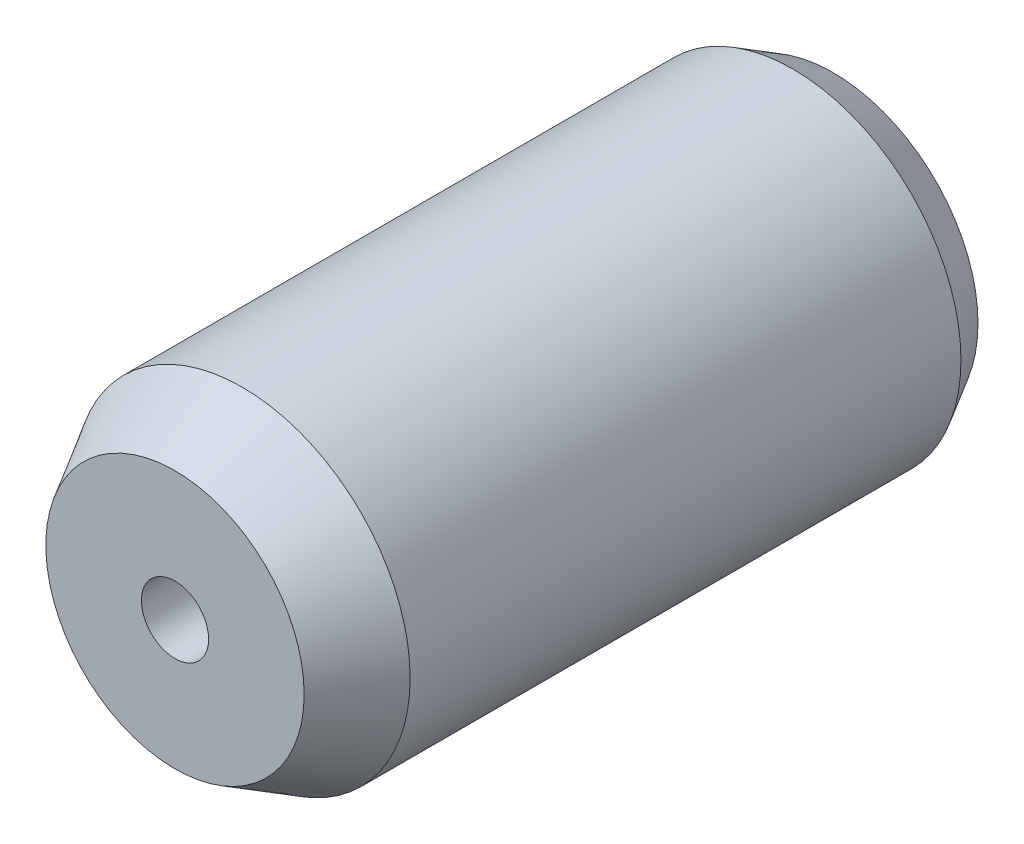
ISO-10303-21;
HEADER;
FILE_DESCRIPTION(('STEP AP214'),'2;1');
FILE_NAME('part.step','',(''),(''),'','','');
FILE_SCHEMA(('AUTOMOTIVE_DESIGN { 1 0 10303 214 1 1 1 1 }'));
ENDSEC;
DATA;
#1=APPLICATION_CONTEXT('core data for automotive mechanical design processes');
#2=APPLICATION_PROTOCOL_DEFINITION('international standard','automotive_design',2000,#1);
#3=PRODUCT_CONTEXT('',#1,'mechanical');
#4=PRODUCT('Part','Part','',(#3));
#5=PRODUCT_RELATED_PRODUCT_CATEGORY('part','',(#4));
#6=PRODUCT_DEFINITION_FORMATION('','',#4);
#7=PRODUCT_DEFINITION_CONTEXT('part definition',#1,'design');
#8=PRODUCT_DEFINITION('design','',#6,#7);
#9=PRODUCT_DEFINITION_SHAPE('','',#8);
#10=(LENGTH_UNIT() NAMED_UNIT(*) SI_UNIT(.MILLI.,.METRE.));
#11=(NAMED_UNIT(*) PLANE_ANGLE_UNIT() SI_UNIT($,.RADIAN.));
#12=(NAMED_UNIT(*) SI_UNIT($,.STERADIAN.) SOLID_ANGLE_UNIT());
#13=UNCERTAINTY_MEASURE_WITH_UNIT(LENGTH_MEASURE(1.E-05),#10,'distance_accuracy_value','');
#14=(GEOMETRIC_REPRESENTATION_CONTEXT(3) GLOBAL_UNCERTAINTY_ASSIGNED_CONTEXT((#13)) GLOBAL_UNIT_ASSIGNED_CONTEXT((#10,
#11,#12)) REPRESENTATION_CONTEXT('',''));
#15=CARTESIAN_POINT('',(0.,0.,0.));
#16=DIRECTION('',(0.,0.,1.));
#17=DIRECTION('',(1.,0.,0.));
#18=AXIS2_PLACEMENT_3D('',#15,#16,#17);
#19=CARTESIAN_POINT('',(0.,0.,0.));
#20=DIRECTION('',(0.,0.,1.));
#21=DIRECTION('',(1.,0.,0.));
#22=AXIS2_PLACEMENT_3D('',#19,#20,#21);
#23=PLANE('',#22);
#24=CARTESIAN_POINT('',(0.,0.,0.));
#25=DIRECTION('',(0.,0.,1.));
#26=DIRECTION('',(1.,0.,0.));
#27=AXIS2_PLACEMENT_3D('',#24,#25,#26);
#28=CIRCLE('',#27,10.7679491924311);
#29=CARTESIAN_POINT('',(10.7679491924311,0.,0.));
#30=VERTEX_POINT('',#29);
#31=EDGE_CURVE('E8',#30,#30,#28,.T.);
#32=ORIENTED_EDGE('',*,*,#31,.F.);
#33=EDGE_LOOP('',(#32));
#34=FACE_BOUND('',#33,.T.);
#35=ADVANCED_FACE('F13',(#34),#23,.F.);
#36=CARTESIAN_POINT('',(0.,0.,3.));
#37=DIRECTION('',(0.,0.,1.));
#38=DIRECTION('',(1.,0.,0.));
#39=AXIS2_PLACEMENT_3D('',#36,#37,#38);
#40=CONICAL_SURFACE('',#39,12.5,0.523598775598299);
#41=ORIENTED_EDGE('',*,*,#31,.T.);
#42=EDGE_LOOP('',(#41));
#43=FACE_BOUND('',#42,.T.);
#44=CARTESIAN_POINT('',(0.,0.,3.));
#45=DIRECTION('',(0.,0.,1.));
#46=DIRECTION('',(1.,0.,0.));
#47=AXIS2_PLACEMENT_3D('',#44,#45,#46);
#48=CIRCLE('',#47,12.5);
#49=CARTESIAN_POINT('',(12.5,0.,3.));
#50=VERTEX_POINT('',#49);
#51=EDGE_CURVE('E19',#50,#50,#48,.T.);
#52=ORIENTED_EDGE('',*,*,#51,.F.);
#53=EDGE_LOOP('',(#52));
#54=FACE_BOUND('',#53,.T.);
#55=ADVANCED_FACE('F61',(#43,#54),#40,.T.);
#56=CARTESIAN_POINT('',(0.,0.,50.));
#57=DIRECTION('',(0.,0.,1.));
#58=DIRECTION('',(1.,0.,0.));
#59=AXIS2_PLACEMENT_3D('',#56,#57,#58);
#60=CYLINDRICAL_SURFACE('',#59,12.5);
#61=CARTESIAN_POINT('',(0.,0.,44.));
#62=DIRECTION('',(0.,0.,1.));
#63=DIRECTION('',(1.,0.,0.));
#64=AXIS2_PLACEMENT_3D('',#61,#62,#63);
#65=CIRCLE('',#64,12.5);
#66=CARTESIAN_POINT('',(12.5,0.,44.));
#67=VERTEX_POINT('',#66);
#68=EDGE_CURVE('E23',#67,#67,#65,.T.);
#69=ORIENTED_EDGE('',*,*,#68,.F.);
#70=EDGE_LOOP('',(#69));
#71=FACE_BOUND('',#70,.T.);
#72=ORIENTED_EDGE('',*,*,#51,.T.);
#73=EDGE_LOOP('',(#72));
#74=FACE_BOUND('',#73,.T.);
#75=ADVANCED_FACE('F56',(#71,#74),#60,.T.);
#76=CARTESIAN_POINT('',(0.,0.,44.));
#77=DIRECTION('',(0.,0.,-1.));
#78=DIRECTION('',(-1.,0.,0.));
#79=AXIS2_PLACEMENT_3D('',#76,#77,#78);
#80=CONICAL_SURFACE('',#79,12.5,0.523598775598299);
#81=CARTESIAN_POINT('',(0.,0.,49.));
#82=DIRECTION('',(0.,0.,1.));
#83=DIRECTION('',(1.,0.,0.));
#84=AXIS2_PLACEMENT_3D('',#81,#82,#83);
#85=CIRCLE('',#84,9.61324865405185);
#86=CARTESIAN_POINT('',(9.61324865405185,0.,49.));
#87=VERTEX_POINT('',#86);
#88=EDGE_CURVE('E27',#87,#87,#85,.T.);
#89=ORIENTED_EDGE('',*,*,#88,.F.);
#90=EDGE_LOOP('',(#89));
#91=FACE_BOUND('',#90,.T.);
#92=ORIENTED_EDGE('',*,*,#68,.T.);
#93=EDGE_LOOP('',(#92));
#94=FACE_BOUND('',#93,.T.);
#95=ADVANCED_FACE('F50',(#91,#94),#80,.T.);
#96=CARTESIAN_POINT('',(9.61324865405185,0.,49.));
#97=DIRECTION('',(0.,0.,-1.));
#98=DIRECTION('',(-1.,0.,0.));
#99=AXIS2_PLACEMENT_3D('',#96,#97,#98);
#100=PLANE('',#99);
#101=CARTESIAN_POINT('',(0.,0.,49.));
#102=DIRECTION('',(0.,0.,1.));
#103=DIRECTION('',(1.,0.,0.));
#104=AXIS2_PLACEMENT_3D('',#101,#102,#103);
#105=CIRCLE('',#104,2.5);
#106=CARTESIAN_POINT('',(2.5,0.,49.));
#107=VERTEX_POINT('',#106);
#108=EDGE_CURVE('E32',#107,#107,#105,.T.);
#109=ORIENTED_EDGE('',*,*,#108,.F.);
#110=EDGE_LOOP('',(#109));
#111=FACE_BOUND('',#110,.T.);
#112=ORIENTED_EDGE('',*,*,#88,.T.);
#113=EDGE_LOOP('',(#112));
#114=FACE_BOUND('',#113,.T.);
#115=ADVANCED_FACE('F44',(#111,#114),#100,.F.);
#116=CARTESIAN_POINT('',(0.,0.,50.));
#117=DIRECTION('',(0.,0.,1.));
#118=DIRECTION('',(1.,0.,0.));
#119=AXIS2_PLACEMENT_3D('',#116,#117,#118);
#120=CYLINDRICAL_SURFACE('',#119,2.5);
#121=CARTESIAN_POINT('',(0.,0.,39.));
#122=DIRECTION('',(0.,0.,1.));
#123=DIRECTION('',(1.,0.,0.));
#124=AXIS2_PLACEMENT_3D('',#121,#122,#123);
#125=CIRCLE('',#124,2.5);
#126=CARTESIAN_POINT('',(2.5,0.,39.));
#127=VERTEX_POINT('',#126);
#128=EDGE_CURVE('E35',#127,#127,#125,.T.);
#129=ORIENTED_EDGE('',*,*,#128,.F.);
#130=EDGE_LOOP('',(#129));
#131=FACE_BOUND('',#130,.T.);
#132=ORIENTED_EDGE('',*,*,#108,.T.);
#133=EDGE_LOOP('',(#132));
#134=FACE_BOUND('',#133,.T.);
#135=ADVANCED_FACE('F41',(#131,#134),#120,.F.);
#136=CARTESIAN_POINT('',(0.,0.,39.));
#137=DIRECTION('',(0.,0.,1.));
#138=DIRECTION('',(1.,0.,0.));
#139=AXIS2_PLACEMENT_3D('',#136,#137,#138);
#140=PLANE('',#139);
#141=ORIENTED_EDGE('',*,*,#128,.T.);
#142=EDGE_LOOP('',(#141));
#143=FACE_BOUND('',#142,.T.);
#144=ADVANCED_FACE('F39',(#143),#140,.T.);
#145=CLOSED_SHELL('',(#35,#55,#75,#95,#115,#135,#144));
#146=MANIFOLD_SOLID_BREP('B1',#145);
#147=ADVANCED_BREP_SHAPE_REPRESENTATION('',(#18,#146),#14);
#148=SHAPE_DEFINITION_REPRESENTATION(#9,#147);
ENDSEC;
END-ISO-10303-21;
